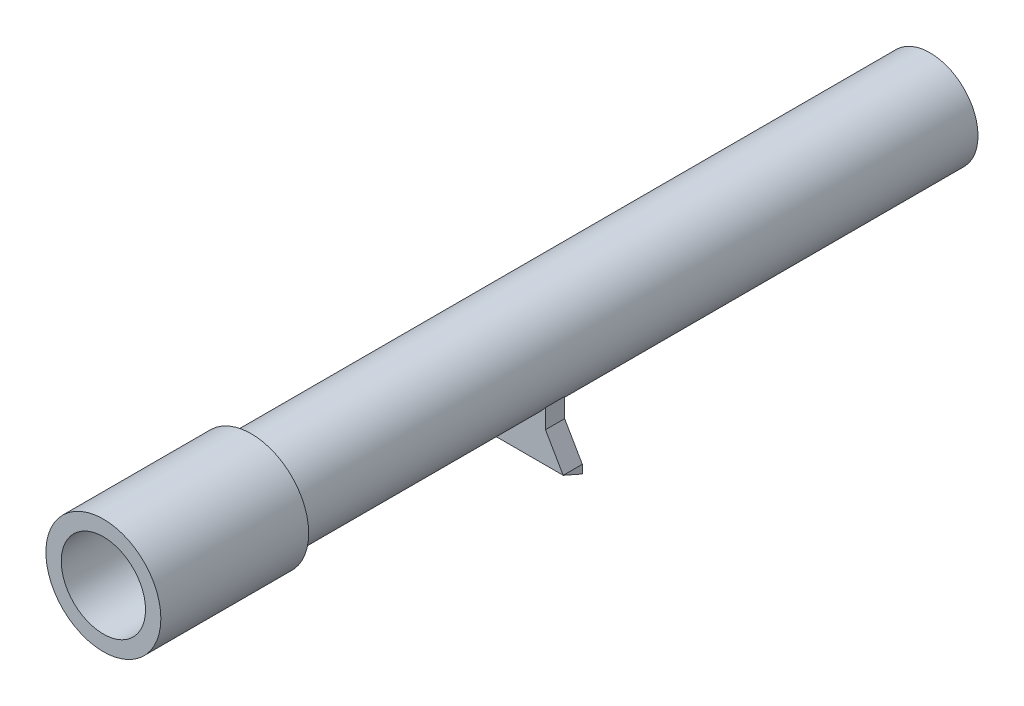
from build123d import *

# Parameters (mm, degrees)
SKETCH1_R           = 15.875
BOSS_EXTRUDE1_DEPTH = 225
SKETCH2_R           = 19.05
BOSS_EXTRUDE2_DEPTH = 49
SKETCH4_W           = 25.4
SKETCH4_H           = 6.35
BOSS_EXTRUDE3_DEPTH = 3.175
BOSS_EXTRUDE4_DEPTH = 6.35
SKETCH6_R           = 13.97
CUT_EXTRUDE1_DEPTH  = 20
BOSS_EXTRUDE5_DEPTH = 5.865879
BOSS_EXTRUDE6_DEPTH = 31.265879


with BuildPart() as part:
    # Sketch1 → Boss-Extrude1 (new body)
    with BuildSketch(Plane.XY):
        Circle(SKETCH1_R)
    extrude(amount=BOSS_EXTRUDE1_DEPTH)

    # Sketch2 → Boss-Extrude2 (add)
    with BuildSketch(Plane.XY.offset(225)):
        Circle(SKETCH2_R)
    extrude(amount=BOSS_EXTRUDE2_DEPTH)

    # Sketch4 → Boss-Extrude3 (add, symmetric)
    with BuildSketch(Plane(origin=(0, 0, 137), x_dir=(-1, 0, 0), z_dir=(0, 0, -1))):
        with Locations((0, -12.7)):
            Rectangle(SKETCH4_W, SKETCH4_H)
    extrude(amount=BOSS_EXTRUDE3_DEPTH, both=True)

    # Sketch5 → Boss-Extrude4 (add)
    with BuildSketch(Plane(origin=(0, 0, 133.825), x_dir=(-1, 0, 0), z_dir=(0, 0, -1))):
        Polygon((-12.7, -15.875), (-18.565878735, -26.035), (18.565878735, -26.035), (12.7, -15.875), align=None)
    extrude(amount=-BOSS_EXTRUDE4_DEPTH)

    # Sketch6 → Cut-Extrude1 (cut)
    with BuildSketch(Plane.XY.offset(274)):
        Circle(SKETCH6_R)
    extrude(amount=-CUT_EXTRUDE1_DEPTH, mode=Mode.SUBTRACT)

    # Sketch8 → Boss-Extrude5 (add)
    with BuildSketch(Plane(origin=(12.7, 0, 0), x_dir=(0, 0, -1), z_dir=(1, 0, 0))):
        Polygon((-140.175, -26.035), (-133.825, -28.829066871), (-133.825, -26.035), align=None)
    extrude(amount=BOSS_EXTRUDE5_DEPTH)

    # Sketch10 → Boss-Extrude6 (add)
    with BuildSketch(Plane.ZY.offset(-12.7)):
        Polygon((133.825, -26.035), (140.175, -26.035), (133.825, -28.829066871), align=None)
    extrude(amount=BOSS_EXTRUDE6_DEPTH)


solid = part.part
